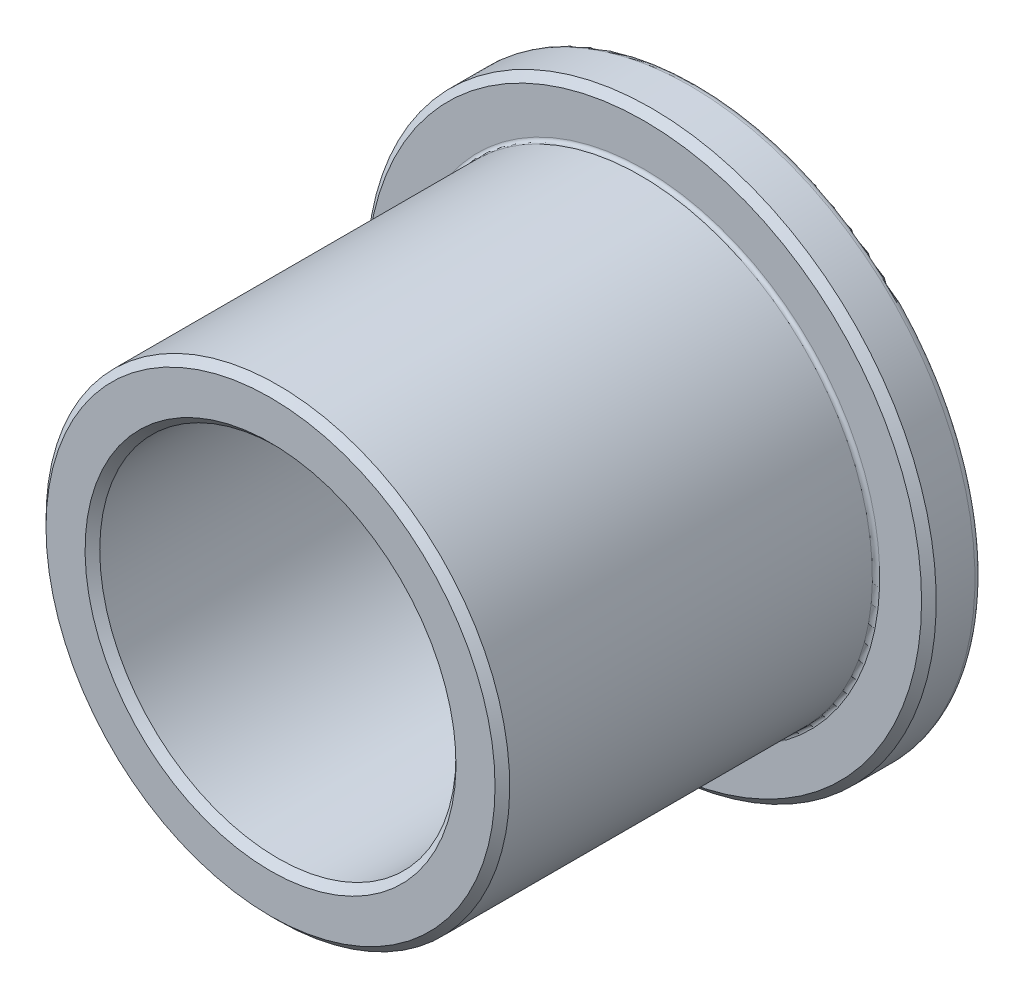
ISO-10303-21;
HEADER;
FILE_DESCRIPTION(('STEP AP214'),'2;1');
FILE_NAME('part.step','',(''),(''),'','','');
FILE_SCHEMA(('AUTOMOTIVE_DESIGN { 1 0 10303 214 1 1 1 1 }'));
ENDSEC;
DATA;
#1=APPLICATION_CONTEXT('core data for automotive mechanical design processes');
#2=APPLICATION_PROTOCOL_DEFINITION('international standard','automotive_design',2000,#1);
#3=PRODUCT_CONTEXT('',#1,'mechanical');
#4=PRODUCT('Part','Part','',(#3));
#5=PRODUCT_RELATED_PRODUCT_CATEGORY('part','',(#4));
#6=PRODUCT_DEFINITION_FORMATION('','',#4);
#7=PRODUCT_DEFINITION_CONTEXT('part definition',#1,'design');
#8=PRODUCT_DEFINITION('design','',#6,#7);
#9=PRODUCT_DEFINITION_SHAPE('','',#8);
#10=(LENGTH_UNIT() NAMED_UNIT(*) SI_UNIT(.MILLI.,.METRE.));
#11=(NAMED_UNIT(*) PLANE_ANGLE_UNIT() SI_UNIT($,.RADIAN.));
#12=(NAMED_UNIT(*) SI_UNIT($,.STERADIAN.) SOLID_ANGLE_UNIT());
#13=UNCERTAINTY_MEASURE_WITH_UNIT(LENGTH_MEASURE(1.E-05),#10,'distance_accuracy_value','');
#14=(GEOMETRIC_REPRESENTATION_CONTEXT(3) GLOBAL_UNCERTAINTY_ASSIGNED_CONTEXT((#13)) GLOBAL_UNIT_ASSIGNED_CONTEXT((#10,
#11,#12)) REPRESENTATION_CONTEXT('',''));
#15=CARTESIAN_POINT('',(0.,0.,0.));
#16=DIRECTION('',(0.,0.,1.));
#17=DIRECTION('',(1.,0.,0.));
#18=AXIS2_PLACEMENT_3D('',#15,#16,#17);
#19=CARTESIAN_POINT('',(0.,8.,-6.));
#20=DIRECTION('',(0.,0.,-1.));
#21=DIRECTION('',(0.,1.,0.));
#22=AXIS2_PLACEMENT_3D('',#19,#20,#21);
#23=PLANE('',#22);
#24=CARTESIAN_POINT('',(0.,0.,-6.));
#25=DIRECTION('',(0.,0.,-1.));
#26=DIRECTION('',(0.,1.,0.));
#27=AXIS2_PLACEMENT_3D('',#24,#25,#26);
#28=CIRCLE('',#27,7.79375);
#29=CARTESIAN_POINT('',(0.,7.79375,-6.));
#30=VERTEX_POINT('',#29);
#31=EDGE_CURVE('E52',#30,#30,#28,.T.);
#32=ORIENTED_EDGE('',*,*,#31,.T.);
#33=EDGE_LOOP('',(#32));
#34=FACE_BOUND('',#33,.T.);
#35=CARTESIAN_POINT('',(0.,0.,-6.));
#36=DIRECTION('',(0.,0.,-1.));
#37=DIRECTION('',(0.,1.,0.));
#38=AXIS2_PLACEMENT_3D('',#35,#36,#37);
#39=CIRCLE('',#38,5.005);
#40=CARTESIAN_POINT('',(0.,5.005,-6.));
#41=VERTEX_POINT('',#40);
#42=EDGE_CURVE('E75',#41,#41,#39,.T.);
#43=ORIENTED_EDGE('',*,*,#42,.F.);
#44=EDGE_LOOP('',(#43));
#45=FACE_BOUND('',#44,.T.);
#46=ADVANCED_FACE('F37',(#34,#45),#23,.T.);
#47=CARTESIAN_POINT('',(0.,0.,-6.));
#48=DIRECTION('',(0.,0.,-1.));
#49=DIRECTION('',(0.,1.,0.));
#50=AXIS2_PLACEMENT_3D('',#47,#48,#49);
#51=CYLINDRICAL_SURFACE('',#50,8.);
#52=CARTESIAN_POINT('',(0.,0.,-5.79375));
#53=DIRECTION('',(0.,0.,-1.));
#54=DIRECTION('',(0.,1.,0.));
#55=AXIS2_PLACEMENT_3D('',#52,#53,#54);
#56=CIRCLE('',#55,8.);
#57=CARTESIAN_POINT('',(0.,8.,-5.79375));
#58=VERTEX_POINT('',#57);
#59=EDGE_CURVE('E48',#58,#58,#56,.F.);
#60=ORIENTED_EDGE('',*,*,#59,.T.);
#61=EDGE_LOOP('',(#60));
#62=FACE_BOUND('',#61,.T.);
#63=CARTESIAN_POINT('',(0.,0.,-4.70625));
#64=DIRECTION('',(0.,0.,1.));
#65=DIRECTION('',(0.,-1.,0.));
#66=AXIS2_PLACEMENT_3D('',#63,#64,#65);
#67=CIRCLE('',#66,8.);
#68=CARTESIAN_POINT('',(0.,8.,-4.70625));
#69=VERTEX_POINT('',#68);
#70=EDGE_CURVE('E72',#69,#69,#67,.F.);
#71=ORIENTED_EDGE('',*,*,#70,.T.);
#72=EDGE_LOOP('',(#71));
#73=FACE_BOUND('',#72,.T.);
#74=ADVANCED_FACE('F82',(#62,#73),#51,.T.);
#75=CARTESIAN_POINT('',(0.,8.,-4.5));
#76=DIRECTION('',(0.,0.,1.));
#77=DIRECTION('',(0.,-1.,0.));
#78=AXIS2_PLACEMENT_3D('',#75,#76,#77);
#79=PLANE('',#78);
#80=CARTESIAN_POINT('',(0.,0.,-4.5));
#81=DIRECTION('',(0.,0.,1.));
#82=DIRECTION('',(0.,-1.,0.));
#83=AXIS2_PLACEMENT_3D('',#80,#81,#82);
#84=CIRCLE('',#83,6.618125);
#85=CARTESIAN_POINT('',(0.,-6.618125,-4.5));
#86=VERTEX_POINT('',#85);
#87=EDGE_CURVE('E44',#86,#86,#84,.F.);
#88=ORIENTED_EDGE('',*,*,#87,.T.);
#89=EDGE_LOOP('',(#88));
#90=FACE_BOUND('',#89,.T.);
#91=CARTESIAN_POINT('',(0.,0.,-4.5));
#92=DIRECTION('',(0.,0.,1.));
#93=DIRECTION('',(0.,-1.,0.));
#94=AXIS2_PLACEMENT_3D('',#91,#92,#93);
#95=CIRCLE('',#94,7.79375);
#96=CARTESIAN_POINT('',(0.,7.79375,-4.5));
#97=VERTEX_POINT('',#96);
#98=EDGE_CURVE('E69',#97,#97,#95,.T.);
#99=ORIENTED_EDGE('',*,*,#98,.T.);
#100=EDGE_LOOP('',(#99));
#101=FACE_BOUND('',#100,.T.);
#102=ADVANCED_FACE('F89',(#90,#101),#79,.T.);
#103=CARTESIAN_POINT('',(0.,0.,-6.));
#104=DIRECTION('',(0.,0.,-1.));
#105=DIRECTION('',(0.,1.,0.));
#106=AXIS2_PLACEMENT_3D('',#103,#104,#105);
#107=CYLINDRICAL_SURFACE('',#106,6.515);
#108=CARTESIAN_POINT('',(0.,0.,-4.396875));
#109=DIRECTION('',(0.,0.,1.));
#110=DIRECTION('',(0.,-1.,0.));
#111=AXIS2_PLACEMENT_3D('',#108,#109,#110);
#112=CIRCLE('',#111,6.515);
#113=CARTESIAN_POINT('',(0.,-6.515,-4.396875));
#114=VERTEX_POINT('',#113);
#115=EDGE_CURVE('E10',#114,#114,#112,.T.);
#116=ORIENTED_EDGE('',*,*,#115,.T.);
#117=EDGE_LOOP('',(#116));
#118=FACE_BOUND('',#117,.T.);
#119=CARTESIAN_POINT('',(0.,0.,5.79375000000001));
#120=DIRECTION('',(0.,0.,1.));
#121=DIRECTION('',(0.,-1.,0.));
#122=AXIS2_PLACEMENT_3D('',#119,#120,#121);
#123=CIRCLE('',#122,6.515);
#124=CARTESIAN_POINT('',(0.,-6.515,5.79375));
#125=VERTEX_POINT('',#124);
#126=EDGE_CURVE('E66',#125,#125,#123,.F.);
#127=ORIENTED_EDGE('',*,*,#126,.T.);
#128=EDGE_LOOP('',(#127));
#129=FACE_BOUND('',#128,.T.);
#130=ADVANCED_FACE('F124',(#118,#129),#107,.T.);
#131=CARTESIAN_POINT('',(0.,6.515,6.));
#132=DIRECTION('',(0.,0.,1.));
#133=DIRECTION('',(0.,-1.,0.));
#134=AXIS2_PLACEMENT_3D('',#131,#132,#133);
#135=PLANE('',#134);
#136=CARTESIAN_POINT('',(0.,0.,6.));
#137=DIRECTION('',(0.,0.,1.));
#138=DIRECTION('',(0.,-1.,0.));
#139=AXIS2_PLACEMENT_3D('',#136,#137,#138);
#140=CIRCLE('',#139,6.30875);
#141=CARTESIAN_POINT('',(0.,-6.30875,6.));
#142=VERTEX_POINT('',#141);
#143=EDGE_CURVE('E60',#142,#142,#140,.T.);
#144=ORIENTED_EDGE('',*,*,#143,.T.);
#145=EDGE_LOOP('',(#144));
#146=FACE_BOUND('',#145,.T.);
#147=CARTESIAN_POINT('',(0.,0.,6.));
#148=DIRECTION('',(0.,0.,1.));
#149=DIRECTION('',(0.,-1.,0.));
#150=AXIS2_PLACEMENT_3D('',#147,#148,#149);
#151=CIRCLE('',#150,5.21124999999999);
#152=CARTESIAN_POINT('',(0.,-5.21124999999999,6.));
#153=VERTEX_POINT('',#152);
#154=EDGE_CURVE('E63',#153,#153,#151,.F.);
#155=ORIENTED_EDGE('',*,*,#154,.T.);
#156=EDGE_LOOP('',(#155));
#157=FACE_BOUND('',#156,.T.);
#158=ADVANCED_FACE('F127',(#146,#157),#135,.T.);
#159=CARTESIAN_POINT('',(0.,0.,-6.));
#160=DIRECTION('',(0.,0.,-1.));
#161=DIRECTION('',(0.,1.,0.));
#162=AXIS2_PLACEMENT_3D('',#159,#160,#161);
#163=CYLINDRICAL_SURFACE('',#162,5.005);
#164=CARTESIAN_POINT('',(0.,0.,5.79375000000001));
#165=DIRECTION('',(0.,0.,1.));
#166=DIRECTION('',(0.,-1.,0.));
#167=AXIS2_PLACEMENT_3D('',#164,#165,#166);
#168=CIRCLE('',#167,5.005);
#169=CARTESIAN_POINT('',(0.,-5.005,5.79375000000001));
#170=VERTEX_POINT('',#169);
#171=EDGE_CURVE('E57',#170,#170,#168,.T.);
#172=ORIENTED_EDGE('',*,*,#171,.T.);
#173=EDGE_LOOP('',(#172));
#174=FACE_BOUND('',#173,.T.);
#175=ORIENTED_EDGE('',*,*,#42,.T.);
#176=EDGE_LOOP('',(#175));
#177=FACE_BOUND('',#176,.T.);
#178=ADVANCED_FACE('F79',(#174,#177),#163,.F.);
#179=CARTESIAN_POINT('',(0.,0.,-4.70625));
#180=DIRECTION('',(0.,0.,-1.));
#181=DIRECTION('',(0.,1.,0.));
#182=AXIS2_PLACEMENT_3D('',#179,#180,#181);
#183=CONICAL_SURFACE('',#182,8.,0.785398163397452);
#184=CARTESIAN_POINT('',(0.,7.79375,-4.5));
#185=CARTESIAN_POINT('',(0.,7.7958984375,-4.5021484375));
#186=CARTESIAN_POINT('',(0.,7.798046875,-4.504296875));
#187=CARTESIAN_POINT('',(0.,7.80234375,-4.50859375));
#188=CARTESIAN_POINT('',(0.,7.8044921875,-4.5107421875));
#189=CARTESIAN_POINT('',(0.,7.8087890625,-4.5150390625));
#190=CARTESIAN_POINT('',(0.,7.8109375,-4.5171875));
#191=CARTESIAN_POINT('',(0.,7.815234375,-4.521484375));
#192=CARTESIAN_POINT('',(0.,7.8173828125,-4.5236328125));
#193=CARTESIAN_POINT('',(0.,7.8216796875,-4.5279296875));
#194=CARTESIAN_POINT('',(0.,7.823828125,-4.530078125));
#195=CARTESIAN_POINT('',(0.,7.828125,-4.534375));
#196=CARTESIAN_POINT('',(0.,7.8302734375,-4.5365234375));
#197=CARTESIAN_POINT('',(0.,7.8345703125,-4.5408203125));
#198=CARTESIAN_POINT('',(0.,7.83671875,-4.54296875));
#199=CARTESIAN_POINT('',(0.,7.841015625,-4.547265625));
#200=CARTESIAN_POINT('',(0.,7.8431640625,-4.5494140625));
#201=CARTESIAN_POINT('',(0.,7.8474609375,-4.5537109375));
#202=CARTESIAN_POINT('',(0.,7.849609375,-4.555859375));
#203=CARTESIAN_POINT('',(0.,7.85390625,-4.56015625));
#204=CARTESIAN_POINT('',(0.,7.8560546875,-4.5623046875));
#205=CARTESIAN_POINT('',(0.,7.8603515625,-4.5666015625));
#206=CARTESIAN_POINT('',(0.,7.8625,-4.56875));
#207=CARTESIAN_POINT('',(0.,7.866796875,-4.573046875));
#208=CARTESIAN_POINT('',(0.,7.8689453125,-4.5751953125));
#209=CARTESIAN_POINT('',(0.,7.8732421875,-4.5794921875));
#210=CARTESIAN_POINT('',(0.,7.875390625,-4.581640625));
#211=CARTESIAN_POINT('',(0.,7.8796875,-4.5859375));
#212=CARTESIAN_POINT('',(0.,7.8818359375,-4.5880859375));
#213=CARTESIAN_POINT('',(0.,7.8861328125,-4.5923828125));
#214=CARTESIAN_POINT('',(0.,7.88828125,-4.59453125));
#215=CARTESIAN_POINT('',(0.,7.892578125,-4.598828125));
#216=CARTESIAN_POINT('',(0.,7.8947265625,-4.6009765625));
#217=CARTESIAN_POINT('',(0.,7.8990234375,-4.6052734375));
#218=CARTESIAN_POINT('',(0.,7.901171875,-4.607421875));
#219=CARTESIAN_POINT('',(0.,7.90546875,-4.61171875));
#220=CARTESIAN_POINT('',(0.,7.9076171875,-4.6138671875));
#221=CARTESIAN_POINT('',(0.,7.9119140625,-4.6181640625));
#222=CARTESIAN_POINT('',(0.,7.9140625,-4.6203125));
#223=CARTESIAN_POINT('',(0.,7.918359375,-4.624609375));
#224=CARTESIAN_POINT('',(0.,7.9205078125,-4.6267578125));
#225=CARTESIAN_POINT('',(0.,7.9248046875,-4.6310546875));
#226=CARTESIAN_POINT('',(0.,7.926953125,-4.633203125));
#227=CARTESIAN_POINT('',(0.,7.93125,-4.6375));
#228=CARTESIAN_POINT('',(0.,7.9333984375,-4.6396484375));
#229=CARTESIAN_POINT('',(0.,7.9376953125,-4.6439453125));
#230=CARTESIAN_POINT('',(0.,7.93984375,-4.64609375));
#231=CARTESIAN_POINT('',(0.,7.944140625,-4.650390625));
#232=CARTESIAN_POINT('',(0.,7.9462890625,-4.6525390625));
#233=CARTESIAN_POINT('',(0.,7.9505859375,-4.6568359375));
#234=CARTESIAN_POINT('',(0.,7.952734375,-4.658984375));
#235=CARTESIAN_POINT('',(0.,7.95703125,-4.66328125));
#236=CARTESIAN_POINT('',(0.,7.9591796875,-4.6654296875));
#237=CARTESIAN_POINT('',(0.,7.9634765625,-4.6697265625));
#238=CARTESIAN_POINT('',(0.,7.965625,-4.671875));
#239=CARTESIAN_POINT('',(0.,7.969921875,-4.676171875));
#240=CARTESIAN_POINT('',(0.,7.9720703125,-4.6783203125));
#241=CARTESIAN_POINT('',(0.,7.9763671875,-4.6826171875));
#242=CARTESIAN_POINT('',(0.,7.978515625,-4.684765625));
#243=CARTESIAN_POINT('',(0.,7.9828125,-4.6890625));
#244=CARTESIAN_POINT('',(0.,7.9849609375,-4.6912109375));
#245=CARTESIAN_POINT('',(0.,7.9892578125,-4.6955078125));
#246=CARTESIAN_POINT('',(0.,7.99140625,-4.69765625));
#247=CARTESIAN_POINT('',(0.,7.995703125,-4.701953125));
#248=CARTESIAN_POINT('',(0.,7.9978515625,-4.7041015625));
#249=CARTESIAN_POINT('',(0.,8.,-4.70625));
#250=B_SPLINE_CURVE_WITH_KNOTS('',3,(#184,#185,#186,#187,#188,#189,#190,#191,#192,#193,#194,
#195,#196,#197,#198,#199,#200,#201,#202,#203,#204,#205,#206,#207,#208,#209,#210,#211,#212,#213,
#214,#215,#216,#217,#218,#219,#220,#221,#222,#223,#224,#225,#226,#227,#228,#229,#230,#231,#232,
#233,#234,#235,#236,#237,#238,#239,#240,#241,#242,#243,#244,#245,#246,#247,#248,#249),
.UNSPECIFIED.,.F.,.F.,(4,2,2,2,2,2,2,2,2,2,2,2,2,2,2,2,2,2,2,2,2,2,2,2,2,2,2,2,2,2,2,2,4),(0.,
0.00911504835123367,0.0182300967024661,0.0273451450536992,0.036460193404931,0.0455752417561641,
0.0546902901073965,0.0638053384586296,0.0729203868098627,0.0820354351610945,0.0911504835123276,
0.100265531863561,0.109380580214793,0.118495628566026,0.127610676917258,0.136725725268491,
0.145840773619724,0.154955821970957,0.16407087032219,0.173185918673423,0.182300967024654,
0.191416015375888,0.20053106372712,0.209646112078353,0.218761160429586,0.227876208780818,
0.236991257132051,0.246106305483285,0.255221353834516,0.26433640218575,0.273451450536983,
0.282566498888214,0.291681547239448),.UNSPECIFIED.);
#251=EDGE_CURVE('BSEAM94',#97,#69,#250,.T.);
#252=ORIENTED_EDGE('',*,*,#98,.F.);
#253=ORIENTED_EDGE('',*,*,#70,.F.);
#254=ORIENTED_EDGE('',*,*,#251,.T.);
#255=ORIENTED_EDGE('',*,*,#251,.F.);
#256=EDGE_LOOP('',(#252,#254,#253,#255));
#257=FACE_BOUND('',#256,.T.);
#258=ADVANCED_FACE('F94',(#257),#183,.T.);
#259=CARTESIAN_POINT('',(0.,0.,5.79375000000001));
#260=DIRECTION('',(0.,0.,-1.));
#261=DIRECTION('',(0.,1.,0.));
#262=AXIS2_PLACEMENT_3D('',#259,#260,#261);
#263=CONICAL_SURFACE('',#262,6.515,0.78539816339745);
#264=ORIENTED_EDGE('',*,*,#143,.F.);
#265=EDGE_LOOP('',(#264));
#266=FACE_BOUND('',#265,.T.);
#267=ORIENTED_EDGE('',*,*,#126,.F.);
#268=EDGE_LOOP('',(#267));
#269=FACE_BOUND('',#268,.T.);
#270=ADVANCED_FACE('F97',(#266,#269),#263,.T.);
#271=CARTESIAN_POINT('',(0.,0.,6.));
#272=DIRECTION('',(0.,0.,1.));
#273=DIRECTION('',(0.,-1.,0.));
#274=AXIS2_PLACEMENT_3D('',#271,#272,#273);
#275=CONICAL_SURFACE('',#274,5.21124999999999,0.785398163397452);
#276=ORIENTED_EDGE('',*,*,#171,.F.);
#277=EDGE_LOOP('',(#276));
#278=FACE_BOUND('',#277,.T.);
#279=ORIENTED_EDGE('',*,*,#154,.F.);
#280=EDGE_LOOP('',(#279));
#281=FACE_BOUND('',#280,.T.);
#282=ADVANCED_FACE('F101',(#278,#281),#275,.F.);
#283=CARTESIAN_POINT('',(0.,0.,-5.79375));
#284=DIRECTION('',(0.,0.,-1.));
#285=DIRECTION('',(0.,1.,0.));
#286=AXIS2_PLACEMENT_3D('',#283,#284,#285);
#287=TOROIDAL_SURFACE('',#286,7.79375,0.20625);
#288=ORIENTED_EDGE('',*,*,#59,.F.);
#289=EDGE_LOOP('',(#288));
#290=FACE_BOUND('',#289,.T.);
#291=ORIENTED_EDGE('',*,*,#31,.F.);
#292=EDGE_LOOP('',(#291));
#293=FACE_BOUND('',#292,.T.);
#294=ADVANCED_FACE('F103',(#290,#293),#287,.T.);
#295=CARTESIAN_POINT('',(0.,0.,-4.396875));
#296=DIRECTION('',(0.,0.,1.));
#297=DIRECTION('',(0.,-1.,0.));
#298=AXIS2_PLACEMENT_3D('',#295,#296,#297);
#299=TOROIDAL_SURFACE('',#298,6.618125,0.103125);
#300=ORIENTED_EDGE('',*,*,#115,.F.);
#301=EDGE_LOOP('',(#300));
#302=FACE_BOUND('',#301,.T.);
#303=ORIENTED_EDGE('',*,*,#87,.F.);
#304=EDGE_LOOP('',(#303));
#305=FACE_BOUND('',#304,.T.);
#306=ADVANCED_FACE('F39',(#302,#305),#299,.F.);
#307=CLOSED_SHELL('',(#46,#74,#102,#130,#158,#178,#258,#270,#282,#294,#306));
#308=MANIFOLD_SOLID_BREP('B2',#307);
#309=ADVANCED_BREP_SHAPE_REPRESENTATION('',(#18,#308),#14);
#310=SHAPE_DEFINITION_REPRESENTATION(#9,#309);
ENDSEC;
END-ISO-10303-21;
